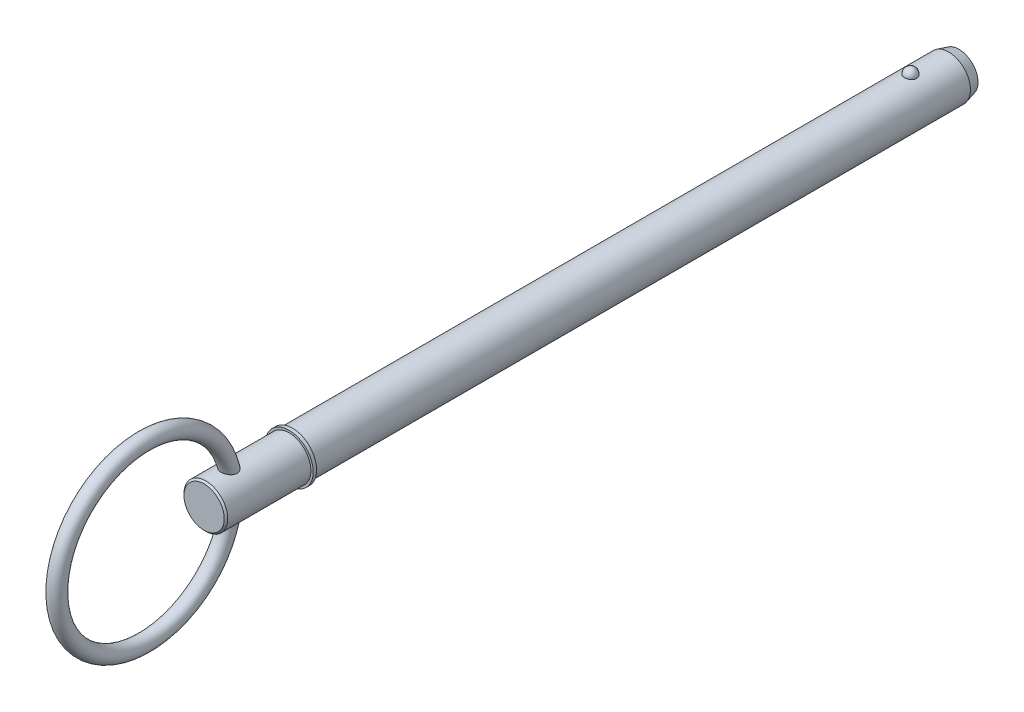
from build123d import *

# Parameters (mm, degrees)
SKETCH2_R           = 6.35
BOSS_EXTRUDE1_DEPTH = 177.8
BOSS_EXTRUDE2_START = 15.88
SKETCH3_R           = 6.35
BOSS_EXTRUDE2_DEPTH = 15.88
CHAMFER1_SIZE       = 3
CHAMFER1_SIZE2      = 0.803847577
SKETCH20_W          = 1
SKETCH20_H          = 7
SKETCH21_R          = 6.35
BOSS_EXTRUDE3_DEPTH = 25.7
CHAMFER2_SIZE       = 0.5
SKETCH24_R          = 2.25


with BuildPart() as part:
    # Sketch2 → Boss-Extrude1 (new body)
    with BuildSketch(Plane.XY):
        Circle(SKETCH2_R)
    extrude(amount=BOSS_EXTRUDE1_DEPTH)

    # Sketch3 → Boss-Extrude2 (add)
    with BuildSketch(Plane(origin=(0, 0, 0), x_dir=(-1, 0, 0), z_dir=(0, 0, -1)).offset(BOSS_EXTRUDE2_START)):
        Circle(SKETCH3_R)
    extrude(amount=-BOSS_EXTRUDE2_DEPTH)

    # Chamfer1
    chamfer1_edges = [part.edges().sort_by_distance(p)[0] for p in [
        (6.35, 0, -15.88),
    ]]
    chamfer1_side = [part.faces().sort_by_distance(p)[0] for p in [
        (6.35, 0, -7.94),
    ]]
    chamfer(chamfer1_edges, length=CHAMFER1_SIZE, length2=CHAMFER1_SIZE2, reference=chamfer1_side[0])

    # Sketch18 → Revolve1 (revolve)
    with BuildSketch(Plane(origin=(0, 0, 0), x_dir=(0, 0, -1), z_dir=(1, 0, 0))):
        with BuildLine():
            Line((1.78, 8.13), (1.78, 4.57))
            ThreePointArc((1.78, 4.57), (0, 6.35), (1.78, 8.13))
        make_face()
    revolve(axis=Axis((0, 8.13, -1.78), (0, -1, 0)))

    # Sketch20 → Revolve2 (revolve)
    with BuildSketch(Plane(origin=(0, 0, 0), x_dir=(0, 0, -1), z_dir=(1, 0, 0)), mode=Mode.PRIVATE) as revolve2_sk:
        with Locations((-178.3, 3.5)):
            Rectangle(SKETCH20_W, SKETCH20_H)
    revolve(revolve2_sk.sketch.rotate(Axis((0, 0, 33.728787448), (0, 0, 1)), 90), axis=Axis((0, 0, 33.728787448), (0, 0, 1)))

    # Sketch21 → Boss-Extrude3 (add)
    with BuildSketch(Plane(origin=(0, 0, 177.8), x_dir=(-1, 0, 0), z_dir=(0, 0, -1))):
        Circle(SKETCH21_R)
    extrude(amount=-BOSS_EXTRUDE3_DEPTH)

    # Chamfer2
    chamfer2_edges = [part.edges().sort_by_distance(p)[0] for p in [
        (6.35, 0, 203.5),
    ]]
    chamfer(chamfer2_edges, length=CHAMFER2_SIZE)

    # Sweep1: sweep along a path in Sketch23
    with BuildLine(Plane(origin=(0, 0, 0), x_dir=(0, 0, -1), z_dir=(1, 0, 0))) as sweep1_path:
        CenterArc((-220.9, 0), 25.4, 0, 360)
    # Sketch24 → Sweep1 (sweep)
    with BuildSketch(Plane(origin=(0, 0, 0), x_dir=(1, 0, 0), z_dir=(0, 1, 0))):
        with Locations((0, -195.5)):
            Circle(SKETCH24_R)
    sweep(path=sweep1_path.line)


solid = part.part
